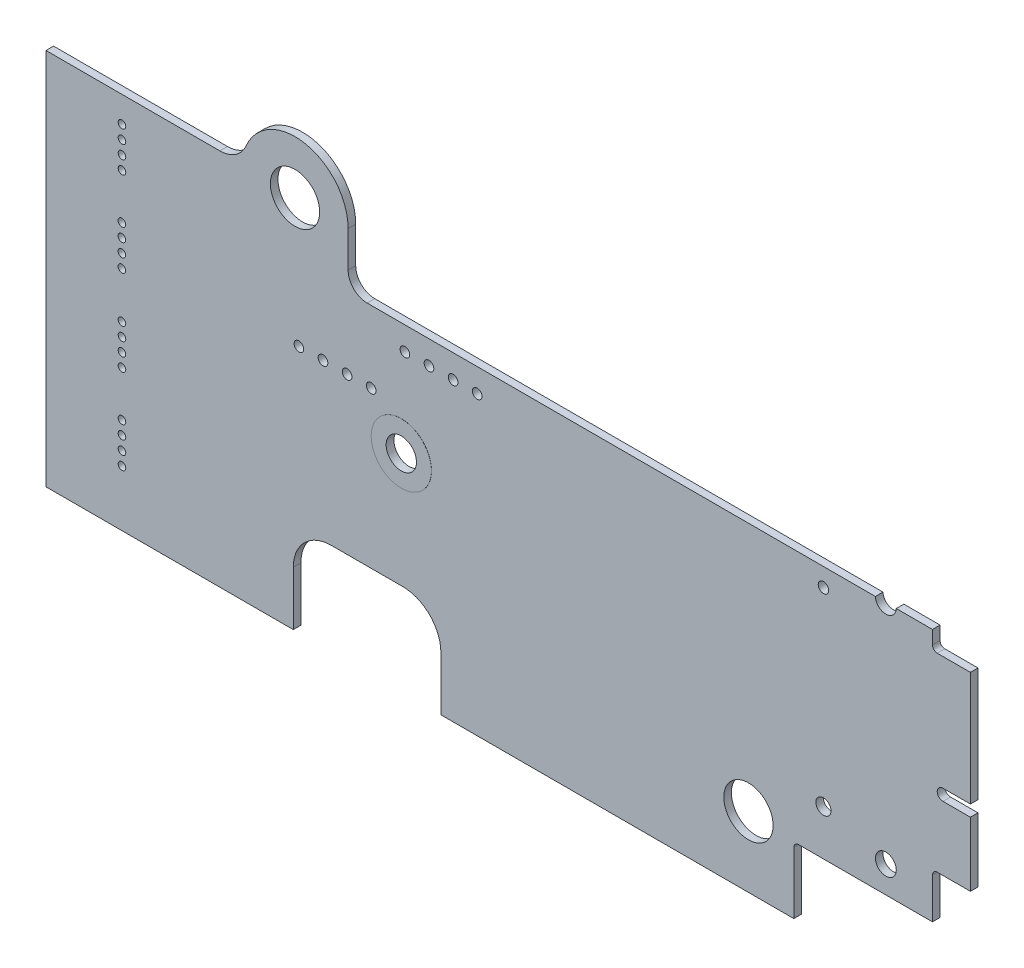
from build123d import *

# Parameters (mm, degrees)
BOARD_DEPTH                  = 0.8
DRILLED_HOLES_PTH_R          = 1.6
DRILLED_HOLES_PTH_R_2        = 0.4
DRILLED_HOLES_PTH_R_3        = 0.508
PLATED_DRILL_HOLES_DEPTH     = 0.8
DRILLED_HOLES_NPTH_R         = 2.599999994
DRILLED_HOLES_NPTH_R_2       = 1.099999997
DRILLED_HOLES_NPTH_R_3       = 0.550000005
DRILLED_HOLES_NPTH_R_4       = 0.8
NON_PLATED_DRILL_HOLES_DEPTH = 108.41825408
BOSS_EXTRUDE2_START          = 0.01
SKETCH13_R                   = 3.175
SKETCH13_R_2                 = 1.6
BOSS_EXTRUDE2_DEPTH          = 0.01
SKETCH14_R                   = 3.175
SKETCH14_R_2                 = 1.6
BOSS_EXTRUDE3_DEPTH          = 0.01


with BuildPart() as part:
    # BOARD_GEOMETRY → Board (new body)
    with BuildSketch(Plane.XY):
        with BuildLine():
            Line((0, 39.85), (0, 0))
            Line((0, 0), (26.079999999, 0))
            Line((26.079999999, 0), (26.079999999, 5.7))
            ThreePointArc((26.079999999, 5.7), (27.251572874, 8.528427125), (30.08, 9.700000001))
            Line((30.08, 9.700000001), (37.640000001, 9.700000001))
            ThreePointArc((37.640000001, 9.700000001), (40.468427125, 8.528427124), (41.639999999, 5.7))
            Line((41.639999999, 5.7), (41.639999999, 0))
            Line((41.639999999, 0), (78.859999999, 0))
            Line((78.859999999, 0), (78.859999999, 6.51))
            ThreePointArc((78.859999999, 6.51), (79.006446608, 6.863553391), (79.36, 7.010000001))
            Line((79.36, 7.010000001), (93.479999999, 7.010000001))
            Line((93.479999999, 7.010000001), (93.479999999, 11.300000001))
            ThreePointArc((93.479999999, 11.300000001), (93.626446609, 11.653553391), (93.98, 11.799999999))
            Line((93.98, 11.799999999), (97.48, 11.799999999))
            Line((97.48, 11.799999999), (97.48, 18.57))
            Line((97.48, 18.57), (94.579999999, 18.57))
            ThreePointArc((94.579999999, 18.57), (93.979999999, 19.17), (94.579999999, 19.77))
            Line((94.579999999, 19.77), (97.48, 19.77))
            Line((97.48, 19.77), (97.48, 31.799999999))
            Line((97.48, 31.799999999), (93.98, 31.799999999))
            ThreePointArc((93.98, 31.799999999), (93.626446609, 31.946446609), (93.479999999, 32.3))
            Line((93.479999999, 32.3), (93.479999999, 33.72))
            Line((93.479999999, 33.72), (89.659999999, 33.72))
            ThreePointArc((89.659999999, 33.72), (88.559999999, 32.659272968), (87.46, 33.72))
            Line((87.46, 33.72), (33.859999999, 33.72))
            ThreePointArc((33.859999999, 33.72), (32.445786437, 34.305786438), (31.860000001, 35.72))
            Line((31.860000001, 35.72), (31.860000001, 39.52))
            ThreePointArc((31.860000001, 39.52), (27.367992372, 45.008132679), (21.1, 41.690000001))
            ThreePointArc((21.1, 41.690000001), (19.993103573, 40.351333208), (18.33, 39.85))
            Line((18.33, 39.85), (0, 39.85))
        make_face()
    extrude(amount=BOARD_DEPTH)

    # DRILLED_HOLES_PTH → Plated_Drill_Holes (cut)
    with BuildSketch(Plane.XY.offset(0.8)):
        with Locations((37.476000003, 21.793)):
            Circle(DRILLED_HOLES_PTH_R)
        with Locations((8.010981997, 10.109356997)):
            Circle(DRILLED_HOLES_PTH_R_2)
        with Locations((8.010981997, 8.709357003)):
            Circle(DRILLED_HOLES_PTH_R_2)
        with Locations((8.010981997, 7.309357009)):
            Circle(DRILLED_HOLES_PTH_R_2)
        with Locations((8.010981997, 5.90935699)):
            Circle(DRILLED_HOLES_PTH_R_2)
        with Locations((8.001, 28.134999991)):
            Circle(DRILLED_HOLES_PTH_R_2)
        with Locations((8.001, 26.734999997)):
            Circle(DRILLED_HOLES_PTH_R_2)
        with Locations((8.001, 25.335000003)):
            Circle(DRILLED_HOLES_PTH_R_2)
        with Locations((8.001, 23.935000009)):
            Circle(DRILLED_HOLES_PTH_R_2)
        with Locations((8.010971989, 19.092367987)):
            Circle(DRILLED_HOLES_PTH_R_2)
        with Locations((8.010971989, 17.692367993)):
            Circle(DRILLED_HOLES_PTH_R_2)
        with Locations((8.010971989, 16.292367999)):
            Circle(DRILLED_HOLES_PTH_R_2)
        with Locations((8.010971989, 14.892368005)):
            Circle(DRILLED_HOLES_PTH_R_2)
        with Locations((8.010971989, 37.109367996)):
            Circle(DRILLED_HOLES_PTH_R_2)
        with Locations((8.010971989, 35.709368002)):
            Circle(DRILLED_HOLES_PTH_R_2)
        with Locations((8.010971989, 34.309368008)):
            Circle(DRILLED_HOLES_PTH_R_2)
        with Locations((8.010971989, 32.909367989)):
            Circle(DRILLED_HOLES_PTH_R_2)
        with Locations((26.67, 26.162)):
            Circle(DRILLED_HOLES_PTH_R_3)
        with Locations((29.21, 26.162)):
            Circle(DRILLED_HOLES_PTH_R_3)
        with Locations((31.75, 26.162)):
            Circle(DRILLED_HOLES_PTH_R_3)
        with Locations((34.29, 26.162)):
            Circle(DRILLED_HOLES_PTH_R_3)
        with Locations((40.386, 31.242)):
            Circle(DRILLED_HOLES_PTH_R_3)
        with Locations((42.926, 31.242)):
            Circle(DRILLED_HOLES_PTH_R_3)
        with Locations((45.466, 31.242)):
            Circle(DRILLED_HOLES_PTH_R_3)
        with Locations((37.846, 31.242)):
            Circle(DRILLED_HOLES_PTH_R_3)
    extrude(amount=-PLATED_DRILL_HOLES_DEPTH, mode=Mode.SUBTRACT)

    # DRILLED_HOLES_NPTH → Non_Plated_Drill_Holes (cut, through all)
    with BuildSketch(Plane.XY.offset(0.8)):
        with Locations((74.07400001, 7.404999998)):
            Circle(DRILLED_HOLES_NPTH_R)
        with Locations((26.259000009, 39.520000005)):
            Circle(DRILLED_HOLES_NPTH_R)
        with Locations((88.56199999, 9.830999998)):
            Circle(DRILLED_HOLES_NPTH_R_2)
        with Locations((81.980999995, 31.79299999)):
            Circle(DRILLED_HOLES_NPTH_R_3)
        with Locations((81.980999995, 11.793000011)):
            Circle(DRILLED_HOLES_NPTH_R_4)
    extrude(amount=-NON_PLATED_DRILL_HOLES_DEPTH, mode=Mode.SUBTRACT)

    # Sketch13 → Boss-Extrude2 (add)
    with BuildSketch(Plane.XY.offset(0.8).offset(BOSS_EXTRUDE2_START)):
        with Locations(Location((37.476000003, 21.793, 0), (0, 0, 180))):
            Circle(SKETCH13_R)
        with Locations((37.476000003, 21.793)):
            Circle(SKETCH13_R_2, mode=Mode.SUBTRACT)
    extrude(amount=-BOSS_EXTRUDE2_DEPTH)

    # Sketch14 → Boss-Extrude3 (add)
    with BuildSketch(Plane(origin=(0, 0, 0), x_dir=(-1, 0, 0), z_dir=(0, 0, -1))):
        with Locations((-37.476000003, 21.793)):
            Circle(SKETCH14_R)
        with Locations(Location((-37.476000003, 21.793, 0), (0, 0, 180))):
            Circle(SKETCH14_R_2, mode=Mode.SUBTRACT)
    extrude(amount=BOSS_EXTRUDE3_DEPTH)


solid = part.part
